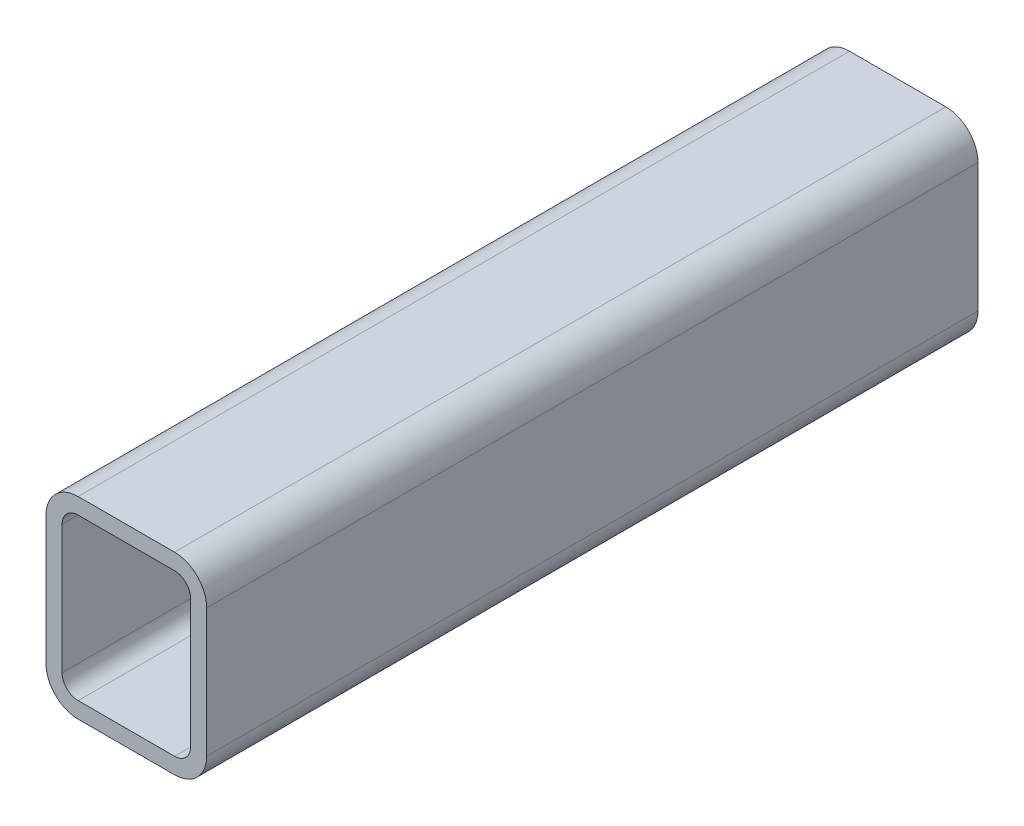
ISO-10303-21;
HEADER;
FILE_DESCRIPTION(('STEP AP214'),'2;1');
FILE_NAME('part.step','',(''),(''),'','','');
FILE_SCHEMA(('AUTOMOTIVE_DESIGN { 1 0 10303 214 1 1 1 1 }'));
ENDSEC;
DATA;
#1=APPLICATION_CONTEXT('core data for automotive mechanical design processes');
#2=APPLICATION_PROTOCOL_DEFINITION('international standard','automotive_design',2000,#1);
#3=PRODUCT_CONTEXT('',#1,'mechanical');
#4=PRODUCT('Part','Part','',(#3));
#5=PRODUCT_RELATED_PRODUCT_CATEGORY('part','',(#4));
#6=PRODUCT_DEFINITION_FORMATION('','',#4);
#7=PRODUCT_DEFINITION_CONTEXT('part definition',#1,'design');
#8=PRODUCT_DEFINITION('design','',#6,#7);
#9=PRODUCT_DEFINITION_SHAPE('','',#8);
#10=(LENGTH_UNIT() NAMED_UNIT(*) SI_UNIT(.MILLI.,.METRE.));
#11=(NAMED_UNIT(*) PLANE_ANGLE_UNIT() SI_UNIT($,.RADIAN.));
#12=(NAMED_UNIT(*) SI_UNIT($,.STERADIAN.) SOLID_ANGLE_UNIT());
#13=UNCERTAINTY_MEASURE_WITH_UNIT(LENGTH_MEASURE(1.E-05),#10,'distance_accuracy_value','');
#14=(GEOMETRIC_REPRESENTATION_CONTEXT(3) GLOBAL_UNCERTAINTY_ASSIGNED_CONTEXT((#13)) GLOBAL_UNIT_ASSIGNED_CONTEXT((#10,
#11,#12)) REPRESENTATION_CONTEXT('',''));
#15=CARTESIAN_POINT('',(0.,0.,0.));
#16=DIRECTION('',(0.,0.,1.));
#17=DIRECTION('',(1.,0.,0.));
#18=AXIS2_PLACEMENT_3D('',#15,#16,#17);
#19=CARTESIAN_POINT('',(15.5960851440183,65.5806737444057,304.8));
#20=DIRECTION('',(0.,0.,1.));
#21=DIRECTION('',(1.,0.,0.));
#22=AXIS2_PLACEMENT_3D('',#19,#20,#21);
#23=PLANE('',#22);
#24=CARTESIAN_POINT('',(15.5960851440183,65.5806737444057,304.8));
#25=DIRECTION('',(0.,0.,1.));
#26=DIRECTION('',(1.,0.,0.));
#27=AXIS2_PLACEMENT_3D('',#24,#25,#26);
#28=CIRCLE('',#27,12.7);
#29=CARTESIAN_POINT('',(15.5960851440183,78.2806737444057,304.8));
#30=VERTEX_POINT('',#29);
#31=CARTESIAN_POINT('',(2.89608514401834,65.5806737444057,304.8));
#32=VERTEX_POINT('',#31);
#33=EDGE_CURVE('E211',#30,#32,#28,.T.);
#34=ORIENTED_EDGE('',*,*,#33,.T.);
#35=DIRECTION('',(0.,-1.,0.));
#36=VECTOR('',#35,1.);
#37=CARTESIAN_POINT('',(2.89608514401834,14.7806737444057,304.8));
#38=LINE('',#37,#36);
#39=CARTESIAN_POINT('',(2.89608514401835,14.7806737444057,304.8));
#40=VERTEX_POINT('',#39);
#41=EDGE_CURVE('E214',#32,#40,#38,.T.);
#42=ORIENTED_EDGE('',*,*,#41,.T.);
#43=CARTESIAN_POINT('',(15.5960851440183,14.7806737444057,304.8));
#44=DIRECTION('',(0.,0.,1.));
#45=DIRECTION('',(1.,0.,0.));
#46=AXIS2_PLACEMENT_3D('',#43,#44,#45);
#47=CIRCLE('',#46,12.7);
#48=CARTESIAN_POINT('',(15.5960851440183,2.0806737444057,304.8));
#49=VERTEX_POINT('',#48);
#50=EDGE_CURVE('E217',#40,#49,#47,.T.);
#51=ORIENTED_EDGE('',*,*,#50,.T.);
#52=DIRECTION('',(1.,0.,0.));
#53=VECTOR('',#52,1.);
#54=CARTESIAN_POINT('',(53.6960851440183,2.0806737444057,304.8));
#55=LINE('',#54,#53);
#56=CARTESIAN_POINT('',(53.6960851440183,2.0806737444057,304.8));
#57=VERTEX_POINT('',#56);
#58=EDGE_CURVE('E219',#49,#57,#55,.T.);
#59=ORIENTED_EDGE('',*,*,#58,.T.);
#60=CARTESIAN_POINT('',(53.6960851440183,14.7806737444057,304.8));
#61=DIRECTION('',(0.,0.,1.));
#62=DIRECTION('',(1.,0.,0.));
#63=AXIS2_PLACEMENT_3D('',#60,#61,#62);
#64=CIRCLE('',#63,12.7);
#65=CARTESIAN_POINT('',(66.3960851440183,14.7806737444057,304.8));
#66=VERTEX_POINT('',#65);
#67=EDGE_CURVE('E221',#57,#66,#64,.T.);
#68=ORIENTED_EDGE('',*,*,#67,.T.);
#69=DIRECTION('',(0.,1.,0.));
#70=VECTOR('',#69,1.);
#71=CARTESIAN_POINT('',(66.3960851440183,65.5806737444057,304.8));
#72=LINE('',#71,#70);
#73=CARTESIAN_POINT('',(66.3960851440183,65.5806737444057,304.8));
#74=VERTEX_POINT('',#73);
#75=EDGE_CURVE('E223',#66,#74,#72,.T.);
#76=ORIENTED_EDGE('',*,*,#75,.T.);
#77=CARTESIAN_POINT('',(53.6960851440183,65.5806737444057,304.8));
#78=DIRECTION('',(0.,0.,1.));
#79=DIRECTION('',(1.,0.,0.));
#80=AXIS2_PLACEMENT_3D('',#77,#78,#79);
#81=CIRCLE('',#80,12.7);
#82=CARTESIAN_POINT('',(53.6960851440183,78.2806737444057,304.8));
#83=VERTEX_POINT('',#82);
#84=EDGE_CURVE('E225',#74,#83,#81,.T.);
#85=ORIENTED_EDGE('',*,*,#84,.T.);
#86=DIRECTION('',(-1.,0.,0.));
#87=VECTOR('',#86,1.);
#88=CARTESIAN_POINT('',(15.5960851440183,78.2806737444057,304.8));
#89=LINE('',#88,#87);
#90=EDGE_CURVE('E227',#83,#30,#89,.T.);
#91=ORIENTED_EDGE('',*,*,#90,.T.);
#92=EDGE_LOOP('',(#34,#42,#51,#59,#68,#76,#85,#91));
#93=FACE_BOUND('',#92,.T.);
#94=DIRECTION('',(0.,-1.,0.));
#95=VECTOR('',#94,1.);
#96=CARTESIAN_POINT('',(9.24608514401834,14.7806737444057,304.8));
#97=LINE('',#96,#95);
#98=CARTESIAN_POINT('',(9.24608514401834,65.5806737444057,304.8));
#99=VERTEX_POINT('',#98);
#100=CARTESIAN_POINT('',(9.24608514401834,14.7806737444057,304.8));
#101=VERTEX_POINT('',#100);
#102=EDGE_CURVE('E154',#99,#101,#97,.T.);
#103=ORIENTED_EDGE('',*,*,#102,.F.);
#104=CARTESIAN_POINT('',(15.5960851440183,65.5806737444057,304.8));
#105=DIRECTION('',(0.,0.,1.));
#106=DIRECTION('',(1.,0.,0.));
#107=AXIS2_PLACEMENT_3D('',#104,#105,#106);
#108=CIRCLE('',#107,6.35000000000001);
#109=CARTESIAN_POINT('',(15.5960851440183,71.9306737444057,304.8));
#110=VERTEX_POINT('',#109);
#111=EDGE_CURVE('E146',#110,#99,#108,.T.);
#112=ORIENTED_EDGE('',*,*,#111,.F.);
#113=DIRECTION('',(-1.,0.,0.));
#114=VECTOR('',#113,1.);
#115=CARTESIAN_POINT('',(15.5960851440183,71.9306737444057,304.8));
#116=LINE('',#115,#114);
#117=CARTESIAN_POINT('',(53.6960851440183,71.9306737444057,304.8));
#118=VERTEX_POINT('',#117);
#119=EDGE_CURVE('E179',#118,#110,#116,.T.);
#120=ORIENTED_EDGE('',*,*,#119,.F.);
#121=CARTESIAN_POINT('',(53.6960851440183,65.5806737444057,304.8));
#122=DIRECTION('',(0.,0.,1.));
#123=DIRECTION('',(1.,0.,0.));
#124=AXIS2_PLACEMENT_3D('',#121,#122,#123);
#125=CIRCLE('',#124,6.35000000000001);
#126=CARTESIAN_POINT('',(60.0460851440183,65.5806737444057,304.8));
#127=VERTEX_POINT('',#126);
#128=EDGE_CURVE('E177',#127,#118,#125,.T.);
#129=ORIENTED_EDGE('',*,*,#128,.F.);
#130=DIRECTION('',(0.,1.,0.));
#131=VECTOR('',#130,1.);
#132=CARTESIAN_POINT('',(60.0460851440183,65.5806737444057,304.8));
#133=LINE('',#132,#131);
#134=CARTESIAN_POINT('',(60.0460851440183,14.7806737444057,304.8));
#135=VERTEX_POINT('',#134);
#136=EDGE_CURVE('E175',#135,#127,#133,.T.);
#137=ORIENTED_EDGE('',*,*,#136,.F.);
#138=CARTESIAN_POINT('',(53.6960851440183,14.7806737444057,304.8));
#139=DIRECTION('',(0.,0.,1.));
#140=DIRECTION('',(1.,0.,0.));
#141=AXIS2_PLACEMENT_3D('',#138,#139,#140);
#142=CIRCLE('',#141,6.35000000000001);
#143=CARTESIAN_POINT('',(53.6960851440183,8.4306737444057,304.8));
#144=VERTEX_POINT('',#143);
#145=EDGE_CURVE('E173',#144,#135,#142,.T.);
#146=ORIENTED_EDGE('',*,*,#145,.F.);
#147=DIRECTION('',(1.,0.,0.));
#148=VECTOR('',#147,1.);
#149=CARTESIAN_POINT('',(53.6960851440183,8.4306737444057,304.8));
#150=LINE('',#149,#148);
#151=CARTESIAN_POINT('',(15.5960851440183,8.4306737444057,304.8));
#152=VERTEX_POINT('',#151);
#153=EDGE_CURVE('E169',#152,#144,#150,.T.);
#154=ORIENTED_EDGE('',*,*,#153,.F.);
#155=CARTESIAN_POINT('',(15.5960851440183,14.7806737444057,304.8));
#156=DIRECTION('',(0.,0.,1.));
#157=DIRECTION('',(1.,0.,0.));
#158=AXIS2_PLACEMENT_3D('',#155,#156,#157);
#159=CIRCLE('',#158,6.35);
#160=EDGE_CURVE('E167',#101,#152,#159,.T.);
#161=ORIENTED_EDGE('',*,*,#160,.F.);
#162=EDGE_LOOP('',(#103,#112,#120,#129,#137,#146,#154,#161));
#163=FACE_BOUND('',#162,.T.);
#164=ADVANCED_FACE('F33',(#93,#163),#23,.T.);
#165=CARTESIAN_POINT('',(15.5960851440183,65.5806737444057,0.));
#166=DIRECTION('',(0.,0.,1.));
#167=DIRECTION('',(1.,0.,0.));
#168=AXIS2_PLACEMENT_3D('',#165,#166,#167);
#169=PLANE('',#168);
#170=CARTESIAN_POINT('',(15.5960851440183,65.5806737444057,0.));
#171=DIRECTION('',(0.,0.,1.));
#172=DIRECTION('',(1.,0.,0.));
#173=AXIS2_PLACEMENT_3D('',#170,#171,#172);
#174=CIRCLE('',#173,12.7);
#175=CARTESIAN_POINT('',(15.5960851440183,78.2806737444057,0.));
#176=VERTEX_POINT('',#175);
#177=CARTESIAN_POINT('',(2.89608514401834,65.5806737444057,0.));
#178=VERTEX_POINT('',#177);
#179=EDGE_CURVE('E162',#176,#178,#174,.T.);
#180=ORIENTED_EDGE('',*,*,#179,.F.);
#181=DIRECTION('',(-1.,0.,0.));
#182=VECTOR('',#181,1.);
#183=CARTESIAN_POINT('',(15.5960851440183,78.2806737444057,0.));
#184=LINE('',#183,#182);
#185=CARTESIAN_POINT('',(53.6960851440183,78.2806737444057,0.));
#186=VERTEX_POINT('',#185);
#187=EDGE_CURVE('E215',#186,#176,#184,.T.);
#188=ORIENTED_EDGE('',*,*,#187,.F.);
#189=CARTESIAN_POINT('',(53.6960851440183,65.5806737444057,0.));
#190=DIRECTION('',(0.,0.,1.));
#191=DIRECTION('',(1.,0.,0.));
#192=AXIS2_PLACEMENT_3D('',#189,#190,#191);
#193=CIRCLE('',#192,12.7);
#194=CARTESIAN_POINT('',(66.3960851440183,65.5806737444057,0.));
#195=VERTEX_POINT('',#194);
#196=EDGE_CURVE('E242',#195,#186,#193,.T.);
#197=ORIENTED_EDGE('',*,*,#196,.F.);
#198=DIRECTION('',(0.,1.,0.));
#199=VECTOR('',#198,1.);
#200=CARTESIAN_POINT('',(66.3960851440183,65.5806737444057,0.));
#201=LINE('',#200,#199);
#202=CARTESIAN_POINT('',(66.3960851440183,14.7806737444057,0.));
#203=VERTEX_POINT('',#202);
#204=EDGE_CURVE('E240',#203,#195,#201,.T.);
#205=ORIENTED_EDGE('',*,*,#204,.F.);
#206=CARTESIAN_POINT('',(53.6960851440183,14.7806737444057,0.));
#207=DIRECTION('',(0.,0.,1.));
#208=DIRECTION('',(1.,0.,0.));
#209=AXIS2_PLACEMENT_3D('',#206,#207,#208);
#210=CIRCLE('',#209,12.7);
#211=CARTESIAN_POINT('',(53.6960851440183,2.0806737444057,0.));
#212=VERTEX_POINT('',#211);
#213=EDGE_CURVE('E238',#212,#203,#210,.T.);
#214=ORIENTED_EDGE('',*,*,#213,.F.);
#215=DIRECTION('',(1.,0.,0.));
#216=VECTOR('',#215,1.);
#217=CARTESIAN_POINT('',(53.6960851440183,2.0806737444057,0.));
#218=LINE('',#217,#216);
#219=CARTESIAN_POINT('',(15.5960851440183,2.0806737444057,0.));
#220=VERTEX_POINT('',#219);
#221=EDGE_CURVE('E236',#220,#212,#218,.T.);
#222=ORIENTED_EDGE('',*,*,#221,.F.);
#223=CARTESIAN_POINT('',(15.5960851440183,14.7806737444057,0.));
#224=DIRECTION('',(0.,0.,1.));
#225=DIRECTION('',(1.,0.,0.));
#226=AXIS2_PLACEMENT_3D('',#223,#224,#225);
#227=CIRCLE('',#226,12.7);
#228=CARTESIAN_POINT('',(2.89608514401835,14.7806737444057,0.));
#229=VERTEX_POINT('',#228);
#230=EDGE_CURVE('E234',#229,#220,#227,.T.);
#231=ORIENTED_EDGE('',*,*,#230,.F.);
#232=DIRECTION('',(0.,-1.,0.));
#233=VECTOR('',#232,1.);
#234=CARTESIAN_POINT('',(2.89608514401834,14.7806737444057,0.));
#235=LINE('',#234,#233);
#236=EDGE_CURVE('E232',#178,#229,#235,.T.);
#237=ORIENTED_EDGE('',*,*,#236,.F.);
#238=EDGE_LOOP('',(#180,#188,#197,#205,#214,#222,#231,#237));
#239=FACE_BOUND('',#238,.T.);
#240=CARTESIAN_POINT('',(15.5960851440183,65.5806737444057,0.));
#241=DIRECTION('',(0.,0.,1.));
#242=DIRECTION('',(1.,0.,0.));
#243=AXIS2_PLACEMENT_3D('',#240,#241,#242);
#244=CIRCLE('',#243,6.35000000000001);
#245=CARTESIAN_POINT('',(15.5960851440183,71.9306737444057,0.));
#246=VERTEX_POINT('',#245);
#247=CARTESIAN_POINT('',(9.24608514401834,65.5806737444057,0.));
#248=VERTEX_POINT('',#247);
#249=EDGE_CURVE('E56',#246,#248,#244,.T.);
#250=ORIENTED_EDGE('',*,*,#249,.T.);
#251=DIRECTION('',(0.,-1.,0.));
#252=VECTOR('',#251,1.);
#253=CARTESIAN_POINT('',(9.24608514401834,14.7806737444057,0.));
#254=LINE('',#253,#252);
#255=CARTESIAN_POINT('',(9.24608514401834,14.7806737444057,0.));
#256=VERTEX_POINT('',#255);
#257=EDGE_CURVE('E161',#248,#256,#254,.T.);
#258=ORIENTED_EDGE('',*,*,#257,.T.);
#259=CARTESIAN_POINT('',(15.5960851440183,14.7806737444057,0.));
#260=DIRECTION('',(0.,0.,1.));
#261=DIRECTION('',(1.,0.,0.));
#262=AXIS2_PLACEMENT_3D('',#259,#260,#261);
#263=CIRCLE('',#262,6.35);
#264=CARTESIAN_POINT('',(15.5960851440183,8.4306737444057,0.));
#265=VERTEX_POINT('',#264);
#266=EDGE_CURVE('E183',#256,#265,#263,.T.);
#267=ORIENTED_EDGE('',*,*,#266,.T.);
#268=DIRECTION('',(1.,0.,0.));
#269=VECTOR('',#268,1.);
#270=CARTESIAN_POINT('',(53.6960851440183,8.4306737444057,0.));
#271=LINE('',#270,#269);
#272=CARTESIAN_POINT('',(53.6960851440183,8.4306737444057,0.));
#273=VERTEX_POINT('',#272);
#274=EDGE_CURVE('E186',#265,#273,#271,.T.);
#275=ORIENTED_EDGE('',*,*,#274,.T.);
#276=CARTESIAN_POINT('',(53.6960851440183,14.7806737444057,0.));
#277=DIRECTION('',(0.,0.,1.));
#278=DIRECTION('',(1.,0.,0.));
#279=AXIS2_PLACEMENT_3D('',#276,#277,#278);
#280=CIRCLE('',#279,6.35000000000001);
#281=CARTESIAN_POINT('',(60.0460851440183,14.7806737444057,0.));
#282=VERTEX_POINT('',#281);
#283=EDGE_CURVE('E189',#273,#282,#280,.T.);
#284=ORIENTED_EDGE('',*,*,#283,.T.);
#285=DIRECTION('',(0.,1.,0.));
#286=VECTOR('',#285,1.);
#287=CARTESIAN_POINT('',(60.0460851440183,65.5806737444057,0.));
#288=LINE('',#287,#286);
#289=CARTESIAN_POINT('',(60.0460851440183,65.5806737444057,0.));
#290=VERTEX_POINT('',#289);
#291=EDGE_CURVE('E192',#282,#290,#288,.T.);
#292=ORIENTED_EDGE('',*,*,#291,.T.);
#293=CARTESIAN_POINT('',(53.6960851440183,65.5806737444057,0.));
#294=DIRECTION('',(0.,0.,1.));
#295=DIRECTION('',(1.,0.,0.));
#296=AXIS2_PLACEMENT_3D('',#293,#294,#295);
#297=CIRCLE('',#296,6.35000000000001);
#298=CARTESIAN_POINT('',(53.6960851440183,71.9306737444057,0.));
#299=VERTEX_POINT('',#298);
#300=EDGE_CURVE('E195',#290,#299,#297,.T.);
#301=ORIENTED_EDGE('',*,*,#300,.T.);
#302=DIRECTION('',(-1.,0.,0.));
#303=VECTOR('',#302,1.);
#304=CARTESIAN_POINT('',(15.5960851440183,71.9306737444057,0.));
#305=LINE('',#304,#303);
#306=EDGE_CURVE('E155',#299,#246,#305,.T.);
#307=ORIENTED_EDGE('',*,*,#306,.T.);
#308=EDGE_LOOP('',(#250,#258,#267,#275,#284,#292,#301,#307));
#309=FACE_BOUND('',#308,.T.);
#310=ADVANCED_FACE('F272',(#239,#309),#169,.F.);
#311=CARTESIAN_POINT('',(15.5960851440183,65.5806737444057,304.8));
#312=DIRECTION('',(0.,0.,-1.));
#313=DIRECTION('',(-1.,0.,0.));
#314=AXIS2_PLACEMENT_3D('',#311,#312,#313);
#315=CYLINDRICAL_SURFACE('',#314,12.7);
#316=ORIENTED_EDGE('',*,*,#179,.T.);
#317=DIRECTION('',(0.,0.,-1.));
#318=VECTOR('',#317,1.);
#319=CARTESIAN_POINT('',(2.89608514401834,65.5806737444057,304.8));
#320=LINE('',#319,#318);
#321=EDGE_CURVE('E11',#32,#178,#320,.T.);
#322=ORIENTED_EDGE('',*,*,#321,.F.);
#323=ORIENTED_EDGE('',*,*,#33,.F.);
#324=DIRECTION('',(0.,0.,-1.));
#325=VECTOR('',#324,1.);
#326=CARTESIAN_POINT('',(15.5960851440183,78.2806737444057,304.8));
#327=LINE('',#326,#325);
#328=EDGE_CURVE('E229',#30,#176,#327,.T.);
#329=ORIENTED_EDGE('',*,*,#328,.T.);
#330=EDGE_LOOP('',(#316,#322,#323,#329));
#331=FACE_BOUND('',#330,.T.);
#332=ADVANCED_FACE('F35',(#331),#315,.T.);
#333=CARTESIAN_POINT('',(2.89608514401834,14.7806737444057,304.8));
#334=DIRECTION('',(1.,0.,0.));
#335=DIRECTION('',(0.,0.,-1.));
#336=AXIS2_PLACEMENT_3D('',#333,#334,#335);
#337=PLANE('',#336);
#338=ORIENTED_EDGE('',*,*,#236,.T.);
#339=DIRECTION('',(0.,0.,-1.));
#340=VECTOR('',#339,1.);
#341=CARTESIAN_POINT('',(2.89608514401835,14.7806737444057,304.8));
#342=LINE('',#341,#340);
#343=EDGE_CURVE('E41',#40,#229,#342,.T.);
#344=ORIENTED_EDGE('',*,*,#343,.F.);
#345=ORIENTED_EDGE('',*,*,#41,.F.);
#346=ORIENTED_EDGE('',*,*,#321,.T.);
#347=EDGE_LOOP('',(#338,#344,#345,#346));
#348=FACE_BOUND('',#347,.T.);
#349=ADVANCED_FACE('F289',(#348),#337,.F.);
#350=CARTESIAN_POINT('',(15.5960851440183,14.7806737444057,304.8));
#351=DIRECTION('',(0.,0.,-1.));
#352=DIRECTION('',(-1.,0.,0.));
#353=AXIS2_PLACEMENT_3D('',#350,#351,#352);
#354=CYLINDRICAL_SURFACE('',#353,12.7);
#355=ORIENTED_EDGE('',*,*,#230,.T.);
#356=DIRECTION('',(0.,0.,-1.));
#357=VECTOR('',#356,1.);
#358=CARTESIAN_POINT('',(15.5960851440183,2.0806737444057,304.8));
#359=LINE('',#358,#357);
#360=EDGE_CURVE('E259',#49,#220,#359,.T.);
#361=ORIENTED_EDGE('',*,*,#360,.F.);
#362=ORIENTED_EDGE('',*,*,#50,.F.);
#363=ORIENTED_EDGE('',*,*,#343,.T.);
#364=EDGE_LOOP('',(#355,#361,#362,#363));
#365=FACE_BOUND('',#364,.T.);
#366=ADVANCED_FACE('F266',(#365),#354,.T.);
#367=CARTESIAN_POINT('',(53.6960851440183,2.0806737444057,304.8));
#368=DIRECTION('',(0.,1.,0.));
#369=DIRECTION('',(0.,0.,1.));
#370=AXIS2_PLACEMENT_3D('',#367,#368,#369);
#371=PLANE('',#370);
#372=ORIENTED_EDGE('',*,*,#221,.T.);
#373=DIRECTION('',(0.,0.,-1.));
#374=VECTOR('',#373,1.);
#375=CARTESIAN_POINT('',(53.6960851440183,2.0806737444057,304.8));
#376=LINE('',#375,#374);
#377=EDGE_CURVE('E256',#57,#212,#376,.T.);
#378=ORIENTED_EDGE('',*,*,#377,.F.);
#379=ORIENTED_EDGE('',*,*,#58,.F.);
#380=ORIENTED_EDGE('',*,*,#360,.T.);
#381=EDGE_LOOP('',(#372,#378,#379,#380));
#382=FACE_BOUND('',#381,.T.);
#383=ADVANCED_FACE('F278',(#382),#371,.F.);
#384=CARTESIAN_POINT('',(53.6960851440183,14.7806737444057,304.8));
#385=DIRECTION('',(0.,0.,-1.));
#386=DIRECTION('',(-1.,0.,0.));
#387=AXIS2_PLACEMENT_3D('',#384,#385,#386);
#388=CYLINDRICAL_SURFACE('',#387,12.7);
#389=ORIENTED_EDGE('',*,*,#213,.T.);
#390=DIRECTION('',(0.,0.,-1.));
#391=VECTOR('',#390,1.);
#392=CARTESIAN_POINT('',(66.3960851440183,14.7806737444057,304.8));
#393=LINE('',#392,#391);
#394=EDGE_CURVE('E253',#66,#203,#393,.T.);
#395=ORIENTED_EDGE('',*,*,#394,.F.);
#396=ORIENTED_EDGE('',*,*,#67,.F.);
#397=ORIENTED_EDGE('',*,*,#377,.T.);
#398=EDGE_LOOP('',(#389,#395,#396,#397));
#399=FACE_BOUND('',#398,.T.);
#400=ADVANCED_FACE('F282',(#399),#388,.T.);
#401=CARTESIAN_POINT('',(66.3960851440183,65.5806737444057,304.8));
#402=DIRECTION('',(-1.,0.,0.));
#403=DIRECTION('',(0.,0.,1.));
#404=AXIS2_PLACEMENT_3D('',#401,#402,#403);
#405=PLANE('',#404);
#406=ORIENTED_EDGE('',*,*,#204,.T.);
#407=DIRECTION('',(0.,0.,-1.));
#408=VECTOR('',#407,1.);
#409=CARTESIAN_POINT('',(66.3960851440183,65.5806737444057,304.8));
#410=LINE('',#409,#408);
#411=EDGE_CURVE('E250',#74,#195,#410,.T.);
#412=ORIENTED_EDGE('',*,*,#411,.F.);
#413=ORIENTED_EDGE('',*,*,#75,.F.);
#414=ORIENTED_EDGE('',*,*,#394,.T.);
#415=EDGE_LOOP('',(#406,#412,#413,#414));
#416=FACE_BOUND('',#415,.T.);
#417=ADVANCED_FACE('F302',(#416),#405,.F.);
#418=CARTESIAN_POINT('',(53.6960851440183,65.5806737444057,304.8));
#419=DIRECTION('',(0.,0.,-1.));
#420=DIRECTION('',(-1.,0.,0.));
#421=AXIS2_PLACEMENT_3D('',#418,#419,#420);
#422=CYLINDRICAL_SURFACE('',#421,12.7);
#423=ORIENTED_EDGE('',*,*,#196,.T.);
#424=DIRECTION('',(0.,0.,-1.));
#425=VECTOR('',#424,1.);
#426=CARTESIAN_POINT('',(53.6960851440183,78.2806737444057,304.8));
#427=LINE('',#426,#425);
#428=EDGE_CURVE('E247',#83,#186,#427,.T.);
#429=ORIENTED_EDGE('',*,*,#428,.F.);
#430=ORIENTED_EDGE('',*,*,#84,.F.);
#431=ORIENTED_EDGE('',*,*,#411,.T.);
#432=EDGE_LOOP('',(#423,#429,#430,#431));
#433=FACE_BOUND('',#432,.T.);
#434=ADVANCED_FACE('F300',(#433),#422,.T.);
#435=CARTESIAN_POINT('',(15.5960851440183,78.2806737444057,304.8));
#436=DIRECTION('',(0.,-1.,0.));
#437=DIRECTION('',(0.,0.,-1.));
#438=AXIS2_PLACEMENT_3D('',#435,#436,#437);
#439=PLANE('',#438);
#440=ORIENTED_EDGE('',*,*,#187,.T.);
#441=ORIENTED_EDGE('',*,*,#328,.F.);
#442=ORIENTED_EDGE('',*,*,#90,.F.);
#443=ORIENTED_EDGE('',*,*,#428,.T.);
#444=EDGE_LOOP('',(#440,#441,#442,#443));
#445=FACE_BOUND('',#444,.T.);
#446=ADVANCED_FACE('F295',(#445),#439,.F.);
#447=CARTESIAN_POINT('',(15.5960851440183,65.5806737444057,304.8));
#448=DIRECTION('',(0.,0.,-1.));
#449=DIRECTION('',(-1.,0.,0.));
#450=AXIS2_PLACEMENT_3D('',#447,#448,#449);
#451=CYLINDRICAL_SURFACE('',#450,6.35000000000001);
#452=ORIENTED_EDGE('',*,*,#249,.F.);
#453=DIRECTION('',(0.,0.,-1.));
#454=VECTOR('',#453,1.);
#455=CARTESIAN_POINT('',(15.5960851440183,71.9306737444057,304.8));
#456=LINE('',#455,#454);
#457=EDGE_CURVE('E150',#110,#246,#456,.T.);
#458=ORIENTED_EDGE('',*,*,#457,.F.);
#459=ORIENTED_EDGE('',*,*,#111,.T.);
#460=DIRECTION('',(0.,0.,-1.));
#461=VECTOR('',#460,1.);
#462=CARTESIAN_POINT('',(9.24608514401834,65.5806737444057,304.8));
#463=LINE('',#462,#461);
#464=EDGE_CURVE('E149',#99,#248,#463,.T.);
#465=ORIENTED_EDGE('',*,*,#464,.T.);
#466=EDGE_LOOP('',(#452,#458,#459,#465));
#467=FACE_BOUND('',#466,.T.);
#468=ADVANCED_FACE('F148',(#467),#451,.F.);
#469=CARTESIAN_POINT('',(9.24608514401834,14.7806737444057,304.8));
#470=DIRECTION('',(1.,0.,0.));
#471=DIRECTION('',(0.,0.,-1.));
#472=AXIS2_PLACEMENT_3D('',#469,#470,#471);
#473=PLANE('',#472);
#474=ORIENTED_EDGE('',*,*,#257,.F.);
#475=ORIENTED_EDGE('',*,*,#464,.F.);
#476=ORIENTED_EDGE('',*,*,#102,.T.);
#477=DIRECTION('',(0.,0.,-1.));
#478=VECTOR('',#477,1.);
#479=CARTESIAN_POINT('',(9.24608514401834,14.7806737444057,304.8));
#480=LINE('',#479,#478);
#481=EDGE_CURVE('E163',#101,#256,#480,.T.);
#482=ORIENTED_EDGE('',*,*,#481,.T.);
#483=EDGE_LOOP('',(#474,#475,#476,#482));
#484=FACE_BOUND('',#483,.T.);
#485=ADVANCED_FACE('F158',(#484),#473,.T.);
#486=CARTESIAN_POINT('',(15.5960851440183,14.7806737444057,304.8));
#487=DIRECTION('',(0.,0.,-1.));
#488=DIRECTION('',(-1.,0.,0.));
#489=AXIS2_PLACEMENT_3D('',#486,#487,#488);
#490=CYLINDRICAL_SURFACE('',#489,6.35);
#491=ORIENTED_EDGE('',*,*,#266,.F.);
#492=ORIENTED_EDGE('',*,*,#481,.F.);
#493=ORIENTED_EDGE('',*,*,#160,.T.);
#494=DIRECTION('',(0.,0.,-1.));
#495=VECTOR('',#494,1.);
#496=CARTESIAN_POINT('',(15.5960851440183,8.4306737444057,304.8));
#497=LINE('',#496,#495);
#498=EDGE_CURVE('E208',#152,#265,#497,.T.);
#499=ORIENTED_EDGE('',*,*,#498,.T.);
#500=EDGE_LOOP('',(#491,#492,#493,#499));
#501=FACE_BOUND('',#500,.T.);
#502=ADVANCED_FACE('F327',(#501),#490,.F.);
#503=CARTESIAN_POINT('',(53.6960851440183,8.4306737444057,304.8));
#504=DIRECTION('',(0.,1.,0.));
#505=DIRECTION('',(0.,0.,1.));
#506=AXIS2_PLACEMENT_3D('',#503,#504,#505);
#507=PLANE('',#506);
#508=ORIENTED_EDGE('',*,*,#274,.F.);
#509=ORIENTED_EDGE('',*,*,#498,.F.);
#510=ORIENTED_EDGE('',*,*,#153,.T.);
#511=DIRECTION('',(0.,0.,-1.));
#512=VECTOR('',#511,1.);
#513=CARTESIAN_POINT('',(53.6960851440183,8.4306737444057,304.8));
#514=LINE('',#513,#512);
#515=EDGE_CURVE('E206',#144,#273,#514,.T.);
#516=ORIENTED_EDGE('',*,*,#515,.T.);
#517=EDGE_LOOP('',(#508,#509,#510,#516));
#518=FACE_BOUND('',#517,.T.);
#519=ADVANCED_FACE('F331',(#518),#507,.T.);
#520=CARTESIAN_POINT('',(53.6960851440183,14.7806737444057,304.8));
#521=DIRECTION('',(0.,0.,-1.));
#522=DIRECTION('',(-1.,0.,0.));
#523=AXIS2_PLACEMENT_3D('',#520,#521,#522);
#524=CYLINDRICAL_SURFACE('',#523,6.35000000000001);
#525=ORIENTED_EDGE('',*,*,#283,.F.);
#526=ORIENTED_EDGE('',*,*,#515,.F.);
#527=ORIENTED_EDGE('',*,*,#145,.T.);
#528=DIRECTION('',(0.,0.,-1.));
#529=VECTOR('',#528,1.);
#530=CARTESIAN_POINT('',(60.0460851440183,14.7806737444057,304.8));
#531=LINE('',#530,#529);
#532=EDGE_CURVE('E204',#135,#282,#531,.T.);
#533=ORIENTED_EDGE('',*,*,#532,.T.);
#534=EDGE_LOOP('',(#525,#526,#527,#533));
#535=FACE_BOUND('',#534,.T.);
#536=ADVANCED_FACE('F337',(#535),#524,.F.);
#537=CARTESIAN_POINT('',(60.0460851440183,65.5806737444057,304.8));
#538=DIRECTION('',(-1.,0.,0.));
#539=DIRECTION('',(0.,0.,1.));
#540=AXIS2_PLACEMENT_3D('',#537,#538,#539);
#541=PLANE('',#540);
#542=ORIENTED_EDGE('',*,*,#291,.F.);
#543=ORIENTED_EDGE('',*,*,#532,.F.);
#544=ORIENTED_EDGE('',*,*,#136,.T.);
#545=DIRECTION('',(0.,0.,-1.));
#546=VECTOR('',#545,1.);
#547=CARTESIAN_POINT('',(60.0460851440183,65.5806737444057,304.8));
#548=LINE('',#547,#546);
#549=EDGE_CURVE('E202',#127,#290,#548,.T.);
#550=ORIENTED_EDGE('',*,*,#549,.T.);
#551=EDGE_LOOP('',(#542,#543,#544,#550));
#552=FACE_BOUND('',#551,.T.);
#553=ADVANCED_FACE('F341',(#552),#541,.T.);
#554=CARTESIAN_POINT('',(53.6960851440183,65.5806737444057,304.8));
#555=DIRECTION('',(0.,0.,-1.));
#556=DIRECTION('',(-1.,0.,0.));
#557=AXIS2_PLACEMENT_3D('',#554,#555,#556);
#558=CYLINDRICAL_SURFACE('',#557,6.35000000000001);
#559=ORIENTED_EDGE('',*,*,#300,.F.);
#560=ORIENTED_EDGE('',*,*,#549,.F.);
#561=ORIENTED_EDGE('',*,*,#128,.T.);
#562=DIRECTION('',(0.,0.,-1.));
#563=VECTOR('',#562,1.);
#564=CARTESIAN_POINT('',(53.6960851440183,71.9306737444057,304.8));
#565=LINE('',#564,#563);
#566=EDGE_CURVE('E48',#118,#299,#565,.T.);
#567=ORIENTED_EDGE('',*,*,#566,.T.);
#568=EDGE_LOOP('',(#559,#560,#561,#567));
#569=FACE_BOUND('',#568,.T.);
#570=ADVANCED_FACE('F345',(#569),#558,.F.);
#571=CARTESIAN_POINT('',(15.5960851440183,71.9306737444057,304.8));
#572=DIRECTION('',(0.,-1.,0.));
#573=DIRECTION('',(0.,0.,-1.));
#574=AXIS2_PLACEMENT_3D('',#571,#572,#573);
#575=PLANE('',#574);
#576=ORIENTED_EDGE('',*,*,#306,.F.);
#577=ORIENTED_EDGE('',*,*,#566,.F.);
#578=ORIENTED_EDGE('',*,*,#119,.T.);
#579=ORIENTED_EDGE('',*,*,#457,.T.);
#580=EDGE_LOOP('',(#576,#577,#578,#579));
#581=FACE_BOUND('',#580,.T.);
#582=ADVANCED_FACE('F349',(#581),#575,.T.);
#583=CLOSED_SHELL('',(#164,#310,#332,#349,#366,#383,#400,#417,#434,#446,#468,#485,#502,#519,
#536,#553,#570,#582));
#584=MANIFOLD_SOLID_BREP('B2',#583);
#585=ADVANCED_BREP_SHAPE_REPRESENTATION('',(#18,#584),#14);
#586=SHAPE_DEFINITION_REPRESENTATION(#9,#585);
ENDSEC;
END-ISO-10303-21;
